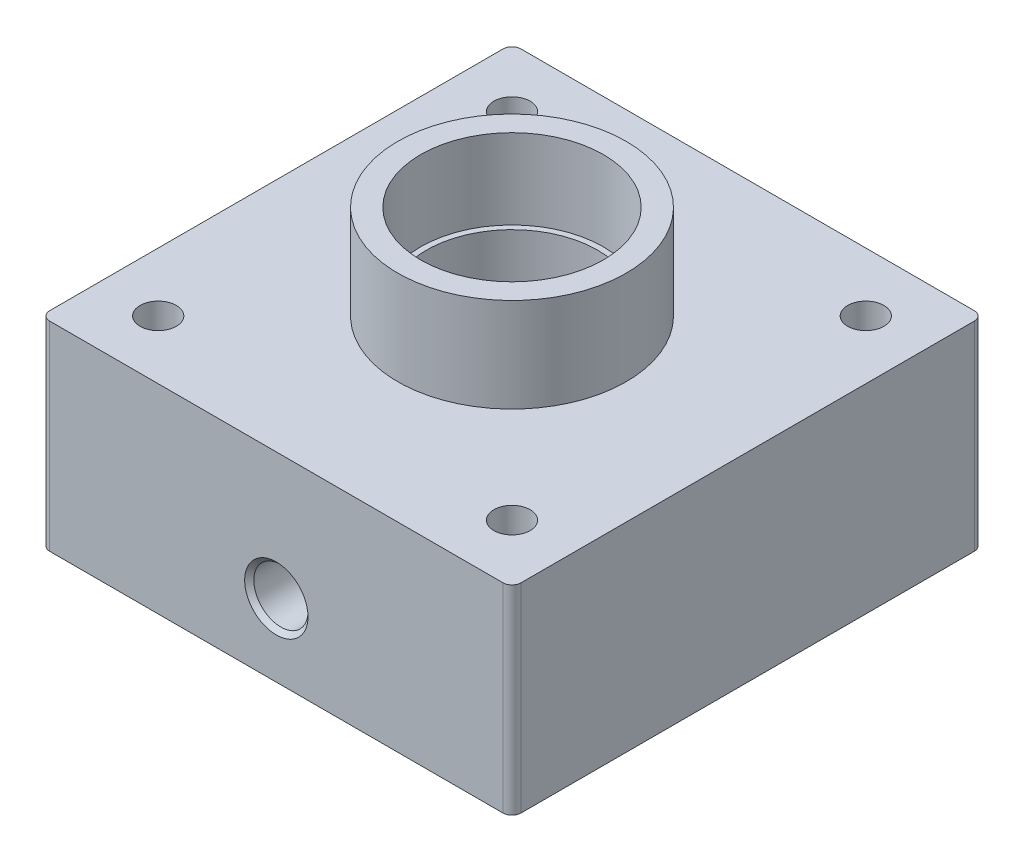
from build123d import *

# Parameters (mm, degrees)
SKETCH1_W                              = 165.1
SKETCH1_H                              = 165.1
BOSS_EXTRUDE1_DEPTH                    = 50.8
SKETCH2_R                              = 40
BOSS_EXTRUDE2_DEPTH                    = 52
SKETCH3_R                              = 32
CUT_EXTRUDE1_DEPTH                     = 28
SKETCH4_R                              = 30
CUT_EXTRUDE2_DEPTH                     = 22
FILLET1_R                              = 3.175
SKETCH5_R                              = 20
CUT_EXTRUDE3_DEPTH                     = 40
SKETCH6_R                              = 76.2
SKETCH6_R_2                            = 69.85
CUT_EXTRUDE4_DEPTH                     = 8
F_1_2_14_NPSM_TAPPED_HOLE1_D           = 18.9738
F_1_2_14_NPSM_TAPPED_HOLE1_DEPTH       = 47.24
F_1_2_14_NPSM_TAPPED_HOLE1_CSINK_D     = 22.1742
F_1_2_14_NPSM_TAPPED_HOLE1_CSINK_ANGLE = 90
F_1_2_14_NPSM_TAPPED_HOLE1_TIP         = 5.700304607
SKETCH10_R                             = 6.35
CUT_EXTRUDE5_DEPTH                     = 25
SKETCH11_R                             = 6.35
CUT_EXTRUDE6_DEPTH                     = 156.553350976
SKETCH12_R                             = 6.35
SKETCH12_R_2                           = 40
BOSS_EXTRUDE4_DEPTH                    = 19.05


with BuildPart() as part:
    # Sketch1 → Boss-Extrude1 (new body)
    with BuildSketch(Plane(origin=(0, 0, 0), x_dir=(1, 0, 0), z_dir=(0, 1, 0))):
        Rectangle(SKETCH1_W, SKETCH1_H)
    extrude(amount=BOSS_EXTRUDE1_DEPTH)

    # Sketch2 → Boss-Extrude2 (add)
    with BuildSketch(Plane(origin=(0, 50.8, 0), x_dir=(1, 0, 0), z_dir=(0, 1, 0))):
        with Locations(Location((0, 0, 0), (0, 0, 90))):
            Circle(SKETCH2_R)
    extrude(amount=BOSS_EXTRUDE2_DEPTH)

    # Sketch3 → Cut-Extrude1 (cut)
    with BuildSketch(Plane(origin=(0, 102.8, 0), x_dir=(1, 0, 0), z_dir=(0, 1, 0))):
        with Locations(Location((0, 0, 0), (0, 0, 270))):
            Circle(SKETCH3_R)
    extrude(amount=-CUT_EXTRUDE1_DEPTH, mode=Mode.SUBTRACT)

    # Sketch4 → Cut-Extrude2 (cut)
    with BuildSketch(Plane(origin=(0, 74.8, 0), x_dir=(1, 0, 0), z_dir=(0, 1, 0))):
        with Locations(Location((0, 0, 0), (0, 0, 270))):
            Circle(SKETCH4_R)
    extrude(amount=-CUT_EXTRUDE2_DEPTH, mode=Mode.SUBTRACT)

    # Fillet1
    fillet1_edges = [part.edges().sort_by_distance(p)[0] for p in [
        (82.55, 25.4, 82.55),
        (-82.55, 25.4, 82.55),
        (-82.55, 25.4, -82.55),
        (82.55, 25.4, -82.55),
    ]]
    fillet(fillet1_edges, radius=FILLET1_R)

    # Sketch5 → Cut-Extrude3 (cut)
    with BuildSketch(Plane.XZ):
        with Locations(Location((0, 0, 0), (0, 0, 270))):
            Circle(SKETCH5_R)
    extrude(amount=-CUT_EXTRUDE3_DEPTH, mode=Mode.SUBTRACT)

    # Sketch6 → Cut-Extrude4 (cut)
    with BuildSketch(Plane.XZ):
        with Locations(Location((0, 0, 0), (0, 0, 270))):
            Circle(SKETCH6_R)
        with Locations(Location((0, 0, 0), (0, 0, 270))):
            Circle(SKETCH6_R_2, mode=Mode.SUBTRACT)
    extrude(amount=-CUT_EXTRUDE4_DEPTH, mode=Mode.SUBTRACT)

    # 1_2-14 NPSM Tapped Hole1
    with Locations(Plane(origin=(0, 25.4, 82.55), x_dir=(1, 0, 0), z_dir=(0, 0, 1))):
        with Locations((0, 0)):
            CounterSinkHole(F_1_2_14_NPSM_TAPPED_HOLE1_D / 2, F_1_2_14_NPSM_TAPPED_HOLE1_CSINK_D / 2, depth=F_1_2_14_NPSM_TAPPED_HOLE1_DEPTH, counter_sink_angle=F_1_2_14_NPSM_TAPPED_HOLE1_CSINK_ANGLE)
            with Locations((0, 0, -(F_1_2_14_NPSM_TAPPED_HOLE1_DEPTH + F_1_2_14_NPSM_TAPPED_HOLE1_TIP / 2))):  # 118° drill point
                Cone(0, F_1_2_14_NPSM_TAPPED_HOLE1_D / 2, F_1_2_14_NPSM_TAPPED_HOLE1_TIP, mode=Mode.SUBTRACT)

    # Sketch10 → Cut-Extrude5 (cut)
    with BuildSketch(Plane.XZ):
        with Locations(Location((0, 50.55, 0), (0, 0, 270))):
            Circle(SKETCH10_R)
    extrude(amount=-CUT_EXTRUDE5_DEPTH, mode=Mode.SUBTRACT)

    # Sketch11 → Cut-Extrude6 (cut, through all)
    with BuildSketch(Plane.XZ):
        with Locations(Location((-61.963767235, 61.963767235, 0), (0, 0, 270))):
            Circle(SKETCH11_R)
        with Locations(Location((61.963767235, 61.963767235, 0), (0, 0, 270))):
            Circle(SKETCH11_R)
        with Locations(Location((61.963767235, -61.963767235, 0), (0, 0, 270))):
            Circle(SKETCH11_R)
        with Locations(Location((-61.963767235, -61.963767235, 0), (0, 0, 270))):
            Circle(SKETCH11_R)
    extrude(amount=-CUT_EXTRUDE6_DEPTH, mode=Mode.SUBTRACT)

    # Sketch12 → Boss-Extrude4 (add)
    with BuildSketch(Plane(origin=(0, 50.8, 0), x_dir=(1, 0, 0), z_dir=(0, 1, 0))):
        with BuildLine():
            ThreePointArc((79.375, -82.55), (81.62006403, -81.62006403), (82.55, -79.375))
            Line((82.55, -79.375), (82.55, 79.375))
            ThreePointArc((82.55, 79.375), (81.62006403, 81.62006403), (79.375, 82.55))
            Line((79.375, 82.55), (-79.375, 82.55))
            ThreePointArc((-79.375, 82.55), (-81.62006403, 81.62006403), (-82.55, 79.375))
            Line((-82.55, 79.375), (-82.55, -79.375))
            ThreePointArc((-82.55, -79.375), (-81.62006403, -81.62006403), (-79.375, -82.55))
            Line((-79.375, -82.55), (79.375, -82.55))
        make_face()
        with Locations(Location((61.963767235, 61.963767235, 0), (0, 0, 90))):
            Circle(SKETCH12_R, mode=Mode.SUBTRACT)
        with Locations(Location((-61.963767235, -61.963767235, 0), (0, 0, 90))):
            Circle(SKETCH12_R, mode=Mode.SUBTRACT)
        with Locations(Location((0, 0, 0), (0, 0, 90))):
            Circle(SKETCH12_R_2, mode=Mode.SUBTRACT)
        with Locations(Location((-61.963767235, 61.963767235, 0), (0, 0, 90))):
            Circle(SKETCH12_R, mode=Mode.SUBTRACT)
        with Locations(Location((61.963767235, -61.963767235, 0), (0, 0, 90))):
            Circle(SKETCH12_R, mode=Mode.SUBTRACT)
    extrude(amount=BOSS_EXTRUDE4_DEPTH)


solid = part.part
